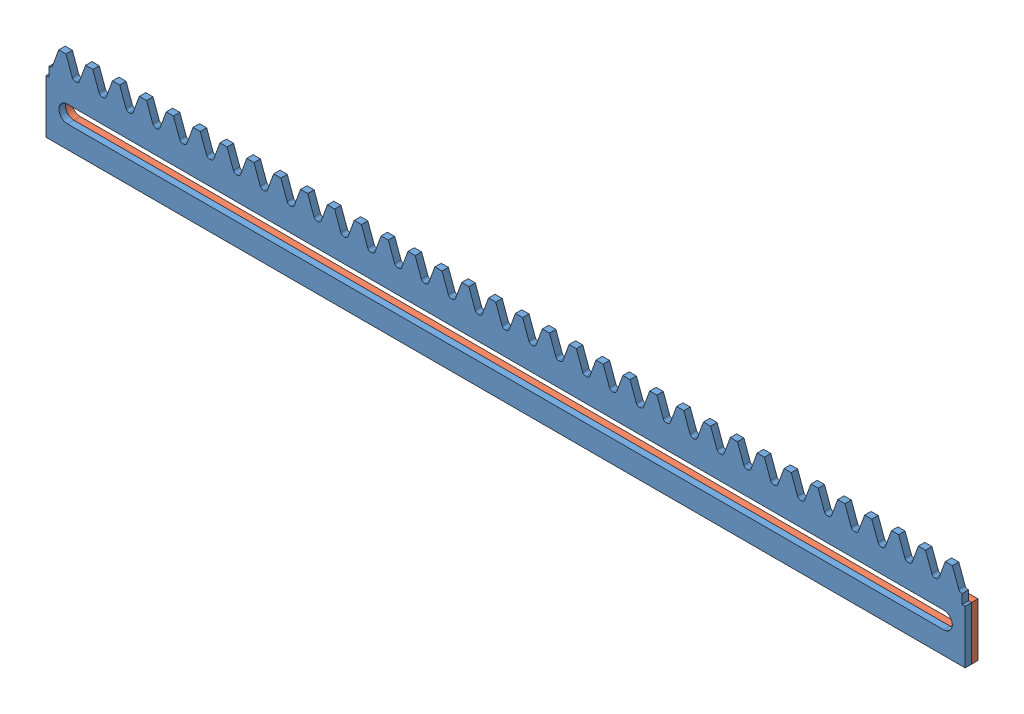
SolidWorks assembly Crémaillère avec support.SLDASM, configuration Défaut (file format 12000). Lengths in mm.
Overall size (430 38.42 6).
2 component instances, 2 part files, 3 mates.
Components (placement in the parent):
- Crémaillère m=4 - 34 dents-1: Crémaillère m=4 - 34 dents.SLDPRT [Défaut] at origin size (430 38.42 3)
- Support Crémaillère-1: Support Crémaillère.SLDPRT [Défaut] at (25.1327 0 -3) size (430 25 3)
Mates (geometry in assembly coordinates):
- Coïncidente1: coincident anti-aligned: plane of Crémaillère m=4 - 34 dents-1 through (424.115 7.1416 -1.5) normal (0 0 -1); plane of Support Crémaillère-1 through (398.9823 7.1416 -1.5) normal (0 0 1)
- Coïncidente2: coincident aligned: plane of Crémaillère m=4 - 34 dents-1 through (425.4867 -34.42 -1.5) normal (1 0 0); plane of Support Crémaillère-1 through (425.4867 -34.42 -4.5) normal (1 0 0)
- Coïncidente3: coincident aligned: plane of Crémaillère m=4 - 34 dents-1 through (-4.5133 -34.42 -1.5) normal (0 -1 0); plane of Support Crémaillère-1 through (-4.5133 -34.42 -4.5) normal (0 -1 0)
